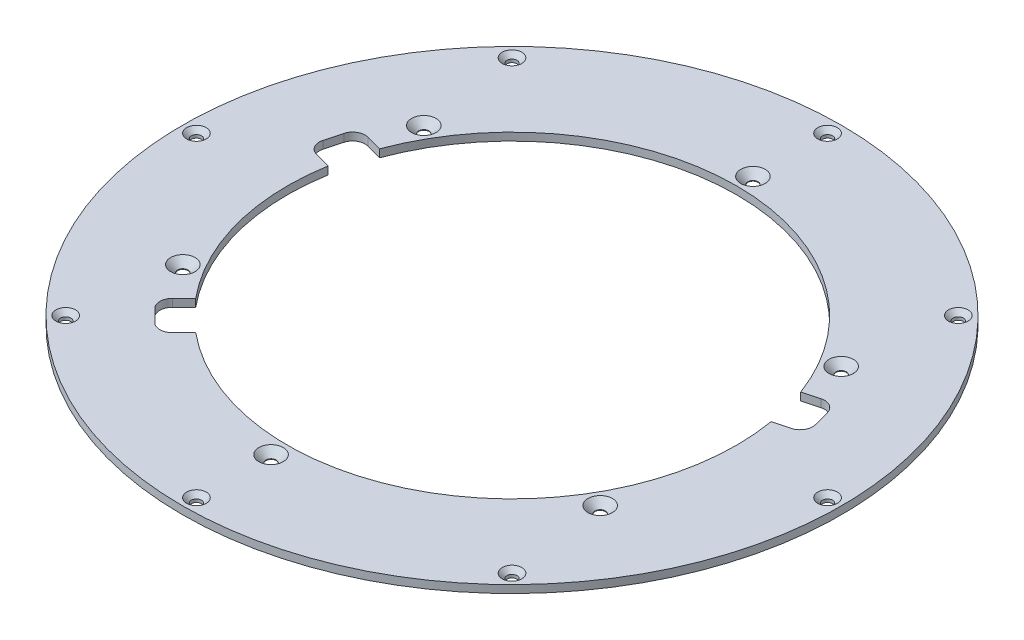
from build123d import *

# Parameters (mm, degrees)
SKETCH1_R           = 134.62
SKETCH1_R_2         = 91.7575
BOSS_EXTRUDE1_DEPTH = 3.175
CIRPATTERN1_COUNT   = 8
CIRPATTERN3_COUNT   = 6
CUT_EXTRUDE2_DEPTH  = 191.407902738
CIRPATTERN4_COUNT   = 12


with BuildPart() as part:
    # Sketch1 → Boss-Extrude1 (new body)
    with BuildSketch(Plane(origin=(0, 0, 0), x_dir=(1, 0, 0), z_dir=(0, 1, 0))):
        with Locations(Location((0, 0, 0), (0, 0, 270))):
            Circle(SKETCH1_R)
        with Locations(Location((0, 0, 0), (0, 0, 270))):
            Circle(SKETCH1_R_2, mode=Mode.SUBTRACT)
    extrude(amount=BOSS_EXTRUDE1_DEPTH)

    # Sketch3 → CSK for M4 Flat Head Machine Screw1 (revolve, cut)
    with BuildSketch(Plane(origin=(0, 3.175, -128.905), x_dir=(0, 0, 1), z_dir=(1, 0, 0))):
        Polygon((0, 0), (0, 3.175), (2.0828, 3.175), (2.0828, 1.9177), (4.0005, 0), align=None)
    csk_for_m4_flat_head_machine_screw1 = revolve(axis=Axis((0, 9.525, -128.905), (0, -1, 0)), mode=Mode.SUBTRACT)

    # CirPattern1: CSK for M4 Flat Head Machine Screw1 ×8 about axis
    cirpattern1_axis = Axis((0, 0, 0), (0, 1, 0))
    for i in range(1, CIRPATTERN1_COUNT):
        add(csk_for_m4_flat_head_machine_screw1.rotate(cirpattern1_axis, i * 360 / CIRPATTERN1_COUNT), mode=Mode.SUBTRACT)

    # Sketch6 → CSK for M4 Flat Head Machine Screw2 (revolve, cut)
    with BuildSketch(Plane(origin=(0, 3.175, -98.425), x_dir=(0, 0, 1), z_dir=(1, 0, 0))):
        Polygon((0, 0), (0, 3.175), (2.0828, 3.175), (2.0828, 2.921), (5.0038, 0), align=None)
    csk_for_m4_flat_head_machine_screw2 = revolve(axis=Axis((0, 9.525, -98.425), (0, -1, 0)), mode=Mode.SUBTRACT)

    # CirPattern3: CSK for M4 Flat Head Machine Screw2 ×6 about axis
    cirpattern3_axis = Axis((0, 0, 0), (0, 1, 0))
    for i in range(1, CIRPATTERN3_COUNT):
        add(csk_for_m4_flat_head_machine_screw2.rotate(cirpattern3_axis, i * 360 / CIRPATTERN3_COUNT), mode=Mode.SUBTRACT)

    # Sketch7 → Cut-Extrude2 (cut, through all)
    with BuildSketch(Plane(origin=(0, 3.175, 0), x_dir=(1, 0, 0), z_dir=(0, 1, 0))):
        with BuildLine():
            Line((-2.218726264, 8.280399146), (92.545841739, 33.672488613))
            ThreePointArc((92.545841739, 33.672488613), (96.400642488, 33.164994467), (98.767545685, 30.080386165))
            Line((98.767545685, 30.080386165), (100.575396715, 23.333394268))
            ThreePointArc((100.575396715, 23.333394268), (100.067902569, 19.478593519), (96.983294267, 17.111690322))
            Line((96.983294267, 17.111690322), (2.218726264, -8.280399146))
            Line((2.218726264, -8.280399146), (-2.218726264, 8.280399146))
        make_face()
    cut_extrude2 = extrude(amount=-CUT_EXTRUDE2_DEPTH, mode=Mode.SUBTRACT)

    # CirPattern4: Cut-Extrude2 ×12 about axis, 9 skipped
    cirpattern4_axis = Axis((0, 3.175, 0), (0, 1, 0))
    add([cut_extrude2.rotate(cirpattern4_axis, i * 360 / CIRPATTERN4_COUNT) for i in range(1, CIRPATTERN4_COUNT) if i not in (1, 2, 3, 4, 6, 8, 9, 10, 11)], mode=Mode.SUBTRACT)


solid = part.part
